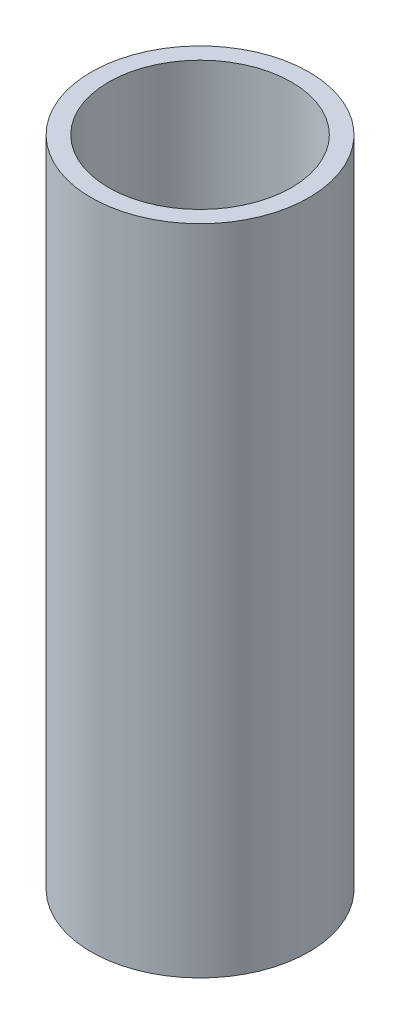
from build123d import *

# Parameters (mm, degrees)
SKETCH1_R           = 12.7
SKETCH1_R_2         = 6.35
BOSS_EXTRUDE1_DEPTH = 38.1
SKETCH2_R           = 10.668
CUT_EXTRUDE1_DEPTH  = 25.4


with BuildPart() as part:
    # Sketch1 → Boss-Extrude1 (new body)
    with BuildSketch(Plane(origin=(0, 0, 0), x_dir=(1, 0, 0), z_dir=(0, 1, 0))):
        with Locations(Location((0, 0, 0), (0, 0, 90))):
            Circle(SKETCH1_R)
        with Locations(Location((0, 0, 0), (0, 0, 90))):
            Circle(SKETCH1_R_2, mode=Mode.SUBTRACT)
    boss_extrude1 = extrude(amount=BOSS_EXTRUDE1_DEPTH)

    # Sketch2 → Cut-Extrude1 (cut)
    with BuildSketch(Plane(origin=(0, 38.1, 0), x_dir=(1, 0, 0), z_dir=(0, 1, 0))):
        with Locations(Location((0, 0, 0), (0, 0, 270))):
            Circle(SKETCH2_R)
    cut_extrude1 = extrude(amount=-CUT_EXTRUDE1_DEPTH, mode=Mode.SUBTRACT)

    # Mirror2: Boss-Extrude1, Cut-Extrude1 across plane
    add(boss_extrude1.mirror(Plane.ZX))
    add(cut_extrude1.mirror(Plane.ZX), mode=Mode.SUBTRACT)


solid = part.part
